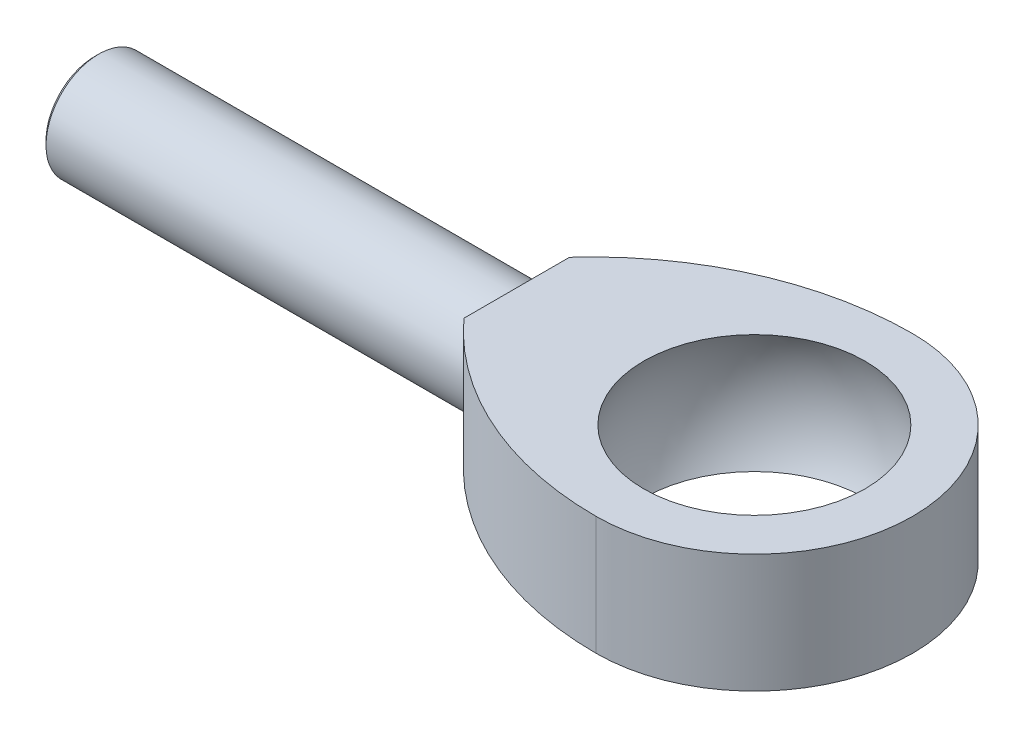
ISO-10303-21;
HEADER;
FILE_DESCRIPTION(('STEP AP214'),'2;1');
FILE_NAME('part.step','',(''),(''),'','','');
FILE_SCHEMA(('AUTOMOTIVE_DESIGN { 1 0 10303 214 1 1 1 1 }'));
ENDSEC;
DATA;
#1=APPLICATION_CONTEXT('core data for automotive mechanical design processes');
#2=APPLICATION_PROTOCOL_DEFINITION('international standard','automotive_design',2000,#1);
#3=PRODUCT_CONTEXT('',#1,'mechanical');
#4=PRODUCT('Part','Part','',(#3));
#5=PRODUCT_RELATED_PRODUCT_CATEGORY('part','',(#4));
#6=PRODUCT_DEFINITION_FORMATION('','',#4);
#7=PRODUCT_DEFINITION_CONTEXT('part definition',#1,'design');
#8=PRODUCT_DEFINITION('design','',#6,#7);
#9=PRODUCT_DEFINITION_SHAPE('','',#8);
#10=(LENGTH_UNIT() NAMED_UNIT(*) SI_UNIT(.MILLI.,.METRE.));
#11=(NAMED_UNIT(*) PLANE_ANGLE_UNIT() SI_UNIT($,.RADIAN.));
#12=(NAMED_UNIT(*) SI_UNIT($,.STERADIAN.) SOLID_ANGLE_UNIT());
#13=UNCERTAINTY_MEASURE_WITH_UNIT(LENGTH_MEASURE(1.E-05),#10,'distance_accuracy_value','');
#14=(GEOMETRIC_REPRESENTATION_CONTEXT(3) GLOBAL_UNCERTAINTY_ASSIGNED_CONTEXT((#13)) GLOBAL_UNIT_ASSIGNED_CONTEXT((#10,
#11,#12)) REPRESENTATION_CONTEXT('',''));
#15=CARTESIAN_POINT('',(0.,0.,0.));
#16=DIRECTION('',(0.,0.,1.));
#17=DIRECTION('',(1.,0.,0.));
#18=AXIS2_PLACEMENT_3D('',#15,#16,#17);
#19=CARTESIAN_POINT('',(-14.3002000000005,27.3888221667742,3.17500000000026));
#20=DIRECTION('',(-1.00000000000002,0.,0.));
#21=DIRECTION('',(0.,0.,1.00000000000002));
#22=AXIS2_PLACEMENT_3D('',#19,#20,#21);
#23=PLANE('',#22);
#24=CARTESIAN_POINT('',(-14.3002,1.45716771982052E-13,0.));
#25=DIRECTION('',(-1.00000000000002,0.,0.));
#26=DIRECTION('',(0.,0.,1.00000000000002));
#27=AXIS2_PLACEMENT_3D('',#24,#25,#26);
#28=CIRCLE('',#27,3.175);
#29=CARTESIAN_POINT('',(-14.3002,0.,3.17500000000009));
#30=VERTEX_POINT('',#29);
#31=CARTESIAN_POINT('',(-14.3002000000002,0.,-3.17499999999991));
#32=VERTEX_POINT('',#31);
#33=EDGE_CURVE('E105',#30,#32,#28,.T.);
#34=ORIENTED_EDGE('',*,*,#33,.F.);
#35=DIRECTION('',(0.,-1.00000000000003,0.));
#36=VECTOR('',#35,1.);
#37=CARTESIAN_POINT('',(-14.3002000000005,27.3888221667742,3.17500000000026));
#38=LINE('',#37,#36);
#39=CARTESIAN_POINT('',(-14.3002,3.56869999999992,3.17499999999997));
#40=VERTEX_POINT('',#39);
#41=EDGE_CURVE('E86',#40,#30,#38,.T.);
#42=ORIENTED_EDGE('',*,*,#41,.F.);
#43=DIRECTION('',(0.,0.,-1.00000000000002));
#44=VECTOR('',#43,1.);
#45=CARTESIAN_POINT('',(-14.3002,3.56869999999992,3.17499999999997));
#46=LINE('',#45,#44);
#47=CARTESIAN_POINT('',(-14.3002000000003,3.56870000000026,-3.17499999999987));
#48=VERTEX_POINT('',#47);
#49=EDGE_CURVE('E97',#40,#48,#46,.T.);
#50=ORIENTED_EDGE('',*,*,#49,.T.);
#51=DIRECTION('',(0.,-1.00000000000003,0.));
#52=VECTOR('',#51,1.);
#53=CARTESIAN_POINT('',(-14.3002000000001,27.3888221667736,-3.17499999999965));
#54=LINE('',#53,#52);
#55=EDGE_CURVE('E107',#48,#32,#54,.T.);
#56=ORIENTED_EDGE('',*,*,#55,.T.);
#57=EDGE_LOOP('',(#34,#42,#50,#56));
#58=FACE_BOUND('',#57,.T.);
#59=ADVANCED_FACE('F38',(#58),#23,.T.);
#60=CARTESIAN_POINT('',(-8.88178419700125E-13,32.8905871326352,1.11022302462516E-13));
#61=DIRECTION('',(0.,1.00000000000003,0.));
#62=DIRECTION('',(0.,0.,1.00000000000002));
#63=AXIS2_PLACEMENT_3D('',#60,#61,#62);
#64=CYLINDRICAL_SURFACE('',#63,9.525);
#65=CARTESIAN_POINT('',(-2.22044604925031E-13,3.56870000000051,0.));
#66=DIRECTION('',(0.,1.00000000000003,0.));
#67=DIRECTION('',(0.,0.,1.00000000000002));
#68=AXIS2_PLACEMENT_3D('',#65,#66,#67);
#69=CIRCLE('',#68,9.525);
#70=CARTESIAN_POINT('',(0.,3.56869999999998,9.52499999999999));
#71=VERTEX_POINT('',#70);
#72=CARTESIAN_POINT('',(0.,3.56870000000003,-9.52500000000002));
#73=VERTEX_POINT('',#72);
#74=EDGE_CURVE('E135',#71,#73,#69,.T.);
#75=ORIENTED_EDGE('',*,*,#74,.F.);
#76=DIRECTION('',(0.,-1.00000000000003,0.));
#77=VECTOR('',#76,1.);
#78=CARTESIAN_POINT('',(-6.66133814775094E-13,27.3888221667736,9.52500000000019));
#79=LINE('',#78,#77);
#80=CARTESIAN_POINT('',(0.,-3.56869999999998,9.52499999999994));
#81=VERTEX_POINT('',#80);
#82=EDGE_CURVE('E130',#71,#81,#79,.T.);
#83=ORIENTED_EDGE('',*,*,#82,.T.);
#84=CARTESIAN_POINT('',(-9.99200722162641E-13,-3.56870000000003,0.));
#85=DIRECTION('',(0.,1.00000000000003,0.));
#86=DIRECTION('',(0.,0.,1.00000000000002));
#87=AXIS2_PLACEMENT_3D('',#84,#85,#86);
#88=CIRCLE('',#87,9.525);
#89=CARTESIAN_POINT('',(-2.77555756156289E-13,-3.56869999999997,-9.52500000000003));
#90=VERTEX_POINT('',#89);
#91=EDGE_CURVE('E133',#81,#90,#88,.T.);
#92=ORIENTED_EDGE('',*,*,#91,.T.);
#93=DIRECTION('',(0.,-1.00000000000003,0.));
#94=VECTOR('',#93,1.);
#95=CARTESIAN_POINT('',(-6.10622663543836E-13,27.3888221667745,-9.52499999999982));
#96=LINE('',#95,#94);
#97=EDGE_CURVE('E61',#73,#90,#96,.T.);
#98=ORIENTED_EDGE('',*,*,#97,.F.);
#99=EDGE_LOOP('',(#75,#83,#92,#98));
#100=FACE_BOUND('',#99,.T.);
#101=ADVANCED_FACE('F154',(#100),#64,.T.);
#102=CARTESIAN_POINT('',(-9.52500000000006,-3.56869999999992,0.));
#103=DIRECTION('',(0.,-1.00000000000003,0.));
#104=DIRECTION('',(0.,0.,-1.00000000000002));
#105=AXIS2_PLACEMENT_3D('',#102,#103,#104);
#106=PLANE('',#105);
#107=CARTESIAN_POINT('',(-9.99200722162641E-13,-3.56870000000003,0.));
#108=DIRECTION('',(0.,1.00000000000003,0.));
#109=DIRECTION('',(0.,0.,1.00000000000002));
#110=AXIS2_PLACEMENT_3D('',#107,#108,#109);
#111=CIRCLE('',#110,6.66071111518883);
#112=CARTESIAN_POINT('',(-6.66071111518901,-3.56870000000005,0.));
#113=VERTEX_POINT('',#112);
#114=EDGE_CURVE('E112',#113,#113,#111,.T.);
#115=ORIENTED_EDGE('',*,*,#114,.T.);
#116=EDGE_LOOP('',(#115));
#117=FACE_BOUND('',#116,.T.);
#118=ORIENTED_EDGE('',*,*,#91,.F.);
#119=CARTESIAN_POINT('',(0.,-3.56869999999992,-9.7520252));
#120=DIRECTION('',(0.,-1.00000000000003,0.));
#121=DIRECTION('',(0.,0.,-1.00000000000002));
#122=AXIS2_PLACEMENT_3D('',#119,#120,#121);
#123=CIRCLE('',#122,19.2770252);
#124=CARTESIAN_POINT('',(-14.3002,-3.56869999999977,3.17500000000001));
#125=VERTEX_POINT('',#124);
#126=EDGE_CURVE('E109',#81,#125,#123,.T.);
#127=ORIENTED_EDGE('',*,*,#126,.T.);
#128=DIRECTION('',(0.,0.,-1.00000000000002));
#129=VECTOR('',#128,1.);
#130=CARTESIAN_POINT('',(-14.3002,-3.56869999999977,3.17500000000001));
#131=LINE('',#130,#129);
#132=CARTESIAN_POINT('',(-14.3002000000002,-3.56870000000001,-3.17499999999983));
#133=VERTEX_POINT('',#132);
#134=EDGE_CURVE('E101',#125,#133,#131,.T.);
#135=ORIENTED_EDGE('',*,*,#134,.T.);
#136=CARTESIAN_POINT('',(0.,-3.56870000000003,9.75202520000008));
#137=DIRECTION('',(0.,-1.00000000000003,0.));
#138=DIRECTION('',(0.,0.,1.00000000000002));
#139=AXIS2_PLACEMENT_3D('',#136,#137,#138);
#140=CIRCLE('',#139,19.2770252);
#141=EDGE_CURVE('E118',#133,#90,#140,.T.);
#142=ORIENTED_EDGE('',*,*,#141,.T.);
#143=EDGE_LOOP('',(#118,#127,#135,#142));
#144=FACE_BOUND('',#143,.T.);
#145=ADVANCED_FACE('F40',(#117,#144),#106,.T.);
#146=CARTESIAN_POINT('',(0.,0.,0.));
#147=DIRECTION('',(0.,1.00000000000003,0.));
#148=DIRECTION('',(-1.00000000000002,0.,0.));
#149=AXIS2_PLACEMENT_3D('',#146,#147,#148);
#150=SPHERICAL_SURFACE('',#149,7.5565);
#151=CARTESIAN_POINT('',(-2.22044604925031E-13,3.56870000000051,0.));
#152=DIRECTION('',(0.,1.00000000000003,0.));
#153=DIRECTION('',(0.,0.,1.00000000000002));
#154=AXIS2_PLACEMENT_3D('',#151,#152,#153);
#155=CIRCLE('',#154,6.66071111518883);
#156=CARTESIAN_POINT('',(-6.66071111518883,3.56870000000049,0.));
#157=VERTEX_POINT('',#156);
#158=EDGE_CURVE('E115',#157,#157,#155,.T.);
#159=CARTESIAN_POINT('',(-6.66071111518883,3.56870000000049,0.));
#160=CARTESIAN_POINT('',(-6.69728047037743,3.5004468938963,0.));
#161=CARTESIAN_POINT('',(-6.73280001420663,3.43163134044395,0.));
#162=CARTESIAN_POINT('',(-6.80170750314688,3.29294115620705,0.));
#163=CARTESIAN_POINT('',(-6.83509544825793,3.22306652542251,0.));
#164=CARTESIAN_POINT('',(-6.89970776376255,3.08232400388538,0.));
#165=CARTESIAN_POINT('',(-6.93093213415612,3.01145611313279,0.));
#166=CARTESIAN_POINT('',(-6.99118790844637,2.86879409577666,0.));
#167=CARTESIAN_POINT('',(-7.02021931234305,2.79699996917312,0.));
#168=CARTESIAN_POINT('',(-7.07606168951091,2.65255330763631,0.));
#169=CARTESIAN_POINT('',(-7.10287266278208,2.57990077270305,0.));
#170=CARTESIAN_POINT('',(-7.15424885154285,2.43380595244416,0.));
#171=CARTESIAN_POINT('',(-7.17881406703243,2.36036366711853,0.));
#172=CARTESIAN_POINT('',(-7.22567552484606,2.21275874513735,0.));
#173=CARTESIAN_POINT('',(-7.24797176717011,2.13859610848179,0.));
#174=CARTESIAN_POINT('',(-7.29027421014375,1.98962056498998,0.));
#175=CARTESIAN_POINT('',(-7.31028041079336,1.91480765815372,0.));
#176=CARTESIAN_POINT('',(-7.34798386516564,1.76460226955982,0.));
#177=CARTESIAN_POINT('',(-7.36568111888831,1.68920978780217,0.));
#178=CARTESIAN_POINT('',(-7.39874995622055,1.53791649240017,0.));
#179=CARTESIAN_POINT('',(-7.41412153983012,1.46201567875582,0.));
#180=CARTESIAN_POINT('',(-7.44252451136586,1.30977744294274,0.));
#181=CARTESIAN_POINT('',(-7.45555589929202,1.23344002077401,0.));
#182=CARTESIAN_POINT('',(-7.47926616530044,1.08040070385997,0.));
#183=CARTESIAN_POINT('',(-7.4899450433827,1.00369880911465,0.));
#184=CARTESIAN_POINT('',(-7.50894019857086,0.850003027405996,0.));
#185=CARTESIAN_POINT('',(-7.51725647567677,0.773009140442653,0.));
#186=CARTESIAN_POINT('',(-7.53151857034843,0.618802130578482,0.));
#187=CARTESIAN_POINT('',(-7.53746438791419,0.541589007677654,0.));
#188=CARTESIAN_POINT('',(-7.54697994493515,0.387016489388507,0.));
#189=CARTESIAN_POINT('',(-7.55054968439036,0.309657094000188,0.));
#190=CARTESIAN_POINT('',(-7.55530971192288,0.154865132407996,0.));
#191=CARTESIAN_POINT('',(-7.55650000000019,0.077432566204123,0.));
#192=CARTESIAN_POINT('',(-7.5565000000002,-0.0774325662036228,0.));
#193=CARTESIAN_POINT('',(-7.55530971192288,-0.154865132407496,0.));
#194=CARTESIAN_POINT('',(-7.55054968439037,-0.309657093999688,0.));
#195=CARTESIAN_POINT('',(-7.54697994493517,-0.387016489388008,0.));
#196=CARTESIAN_POINT('',(-7.53746438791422,-0.541589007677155,0.));
#197=CARTESIAN_POINT('',(-7.53151857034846,-0.618802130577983,0.));
#198=CARTESIAN_POINT('',(-7.51725647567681,-0.773009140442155,0.));
#199=CARTESIAN_POINT('',(-7.5089401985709,-0.850003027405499,0.));
#200=CARTESIAN_POINT('',(-7.48994504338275,-1.00369880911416,0.));
#201=CARTESIAN_POINT('',(-7.4792661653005,-1.08040070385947,0.));
#202=CARTESIAN_POINT('',(-7.45555589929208,-1.23344002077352,0.));
#203=CARTESIAN_POINT('',(-7.44252451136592,-1.30977744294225,0.));
#204=CARTESIAN_POINT('',(-7.4141215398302,-1.46201567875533,0.));
#205=CARTESIAN_POINT('',(-7.39874995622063,-1.53791649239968,0.));
#206=CARTESIAN_POINT('',(-7.3656811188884,-1.68920978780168,0.));
#207=CARTESIAN_POINT('',(-7.34798386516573,-1.76460226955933,0.));
#208=CARTESIAN_POINT('',(-7.31028041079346,-1.91480765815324,0.));
#209=CARTESIAN_POINT('',(-7.29027421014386,-1.9896205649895,0.));
#210=CARTESIAN_POINT('',(-7.24797176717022,-2.13859610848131,0.));
#211=CARTESIAN_POINT('',(-7.22567552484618,-2.21275874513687,0.));
#212=CARTESIAN_POINT('',(-7.17881406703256,-2.36036366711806,0.));
#213=CARTESIAN_POINT('',(-7.15424885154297,-2.43380595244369,0.));
#214=CARTESIAN_POINT('',(-7.10287266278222,-2.57990077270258,0.));
#215=CARTESIAN_POINT('',(-7.07606168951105,-2.65255330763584,0.));
#216=CARTESIAN_POINT('',(-7.0202193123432,-2.79699996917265,0.));
#217=CARTESIAN_POINT('',(-6.99118790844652,-2.8687940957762,0.));
#218=CARTESIAN_POINT('',(-6.93093213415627,-3.01145611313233,0.));
#219=CARTESIAN_POINT('',(-6.89970776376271,-3.08232400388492,0.));
#220=CARTESIAN_POINT('',(-6.8350954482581,-3.22306652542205,0.));
#221=CARTESIAN_POINT('',(-6.80170750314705,-3.2929411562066,0.));
#222=CARTESIAN_POINT('',(-6.73280001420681,-3.4316313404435,0.));
#223=CARTESIAN_POINT('',(-6.69728047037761,-3.50044689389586,0.));
#224=CARTESIAN_POINT('',(-6.66071111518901,-3.56870000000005,0.));
#225=B_SPLINE_CURVE_WITH_KNOTS('',3,(#159,#160,#161,#162,#163,#164,#165,#166,#167,#168,#169,
#170,#171,#172,#173,#174,#175,#176,#177,#178,#179,#180,#181,#182,#183,#184,#185,#186,#187,#188,
#189,#190,#191,#192,#193,#194,#195,#196,#197,#198,#199,#200,#201,#202,#203,#204,#205,#206,#207,
#208,#209,#210,#211,#212,#213,#214,#215,#216,#217,#218,#219,#220,#221,#222,#223,#224),
.UNSPECIFIED.,.F.,.F.,(4,2,2,2,2,2,2,2,2,2,2,2,2,2,2,2,2,2,2,2,2,2,2,2,2,2,2,2,2,2,2,2,4),(0.,
0.23228855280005,0.4645771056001,0.69686565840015,0.9291542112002,1.16144276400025,
1.3937313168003,1.62601986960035,1.8583084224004,2.09059697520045,2.3228855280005,
2.55517408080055,2.7874626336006,3.01975118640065,3.2520397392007,3.48432829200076,
3.71661684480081,3.94890539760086,4.18119395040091,4.41348250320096,4.64577105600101,
4.87805960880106,5.11034816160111,5.34263671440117,5.57492526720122,5.80721382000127,
6.03950237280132,6.27179092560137,6.50407947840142,6.73636803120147,6.96865658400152,
7.20094513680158,7.43323368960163),.UNSPECIFIED.);
#226=EDGE_CURVE('BSEAM140',#157,#113,#225,.T.);
#227=ORIENTED_EDGE('',*,*,#158,.T.);
#228=ORIENTED_EDGE('',*,*,#114,.F.);
#229=ORIENTED_EDGE('',*,*,#226,.T.);
#230=ORIENTED_EDGE('',*,*,#226,.F.);
#231=EDGE_LOOP('',(#227,#229,#228,#230));
#232=FACE_BOUND('',#231,.T.);
#233=ADVANCED_FACE('F140',(#232),#150,.F.);
#234=CARTESIAN_POINT('',(-9.52500000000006,3.56870000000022,0.));
#235=DIRECTION('',(0.,1.00000000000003,0.));
#236=DIRECTION('',(0.,0.,1.00000000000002));
#237=AXIS2_PLACEMENT_3D('',#234,#235,#236);
#238=PLANE('',#237);
#239=ORIENTED_EDGE('',*,*,#74,.T.);
#240=CARTESIAN_POINT('',(0.,3.56870000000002,9.75202520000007));
#241=DIRECTION('',(0.,1.00000000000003,0.));
#242=DIRECTION('',(0.,0.,1.00000000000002));
#243=AXIS2_PLACEMENT_3D('',#240,#241,#242);
#244=CIRCLE('',#243,19.2770252);
#245=EDGE_CURVE('E124',#48,#73,#244,.F.);
#246=ORIENTED_EDGE('',*,*,#245,.F.);
#247=ORIENTED_EDGE('',*,*,#49,.F.);
#248=CARTESIAN_POINT('',(0.,3.5687000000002,-9.75202519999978));
#249=DIRECTION('',(0.,1.00000000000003,0.));
#250=DIRECTION('',(0.,0.,1.00000000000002));
#251=AXIS2_PLACEMENT_3D('',#248,#249,#250);
#252=CIRCLE('',#251,19.2770252);
#253=EDGE_CURVE('E93',#71,#40,#252,.F.);
#254=ORIENTED_EDGE('',*,*,#253,.F.);
#255=EDGE_LOOP('',(#239,#246,#247,#254));
#256=FACE_BOUND('',#255,.T.);
#257=ORIENTED_EDGE('',*,*,#158,.F.);
#258=EDGE_LOOP('',(#257));
#259=FACE_BOUND('',#258,.T.);
#260=ADVANCED_FACE('F143',(#256,#259),#238,.T.);
#261=CARTESIAN_POINT('',(0.,27.3888221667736,-9.75202519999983));
#262=DIRECTION('',(0.,-1.00000000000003,0.));
#263=DIRECTION('',(0.,0.,-1.00000000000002));
#264=AXIS2_PLACEMENT_3D('',#261,#262,#263);
#265=CYLINDRICAL_SURFACE('',#264,19.2770252);
#266=ORIENTED_EDGE('',*,*,#82,.F.);
#267=ORIENTED_EDGE('',*,*,#253,.T.);
#268=ORIENTED_EDGE('',*,*,#41,.T.);
#269=EDGE_CURVE('E90',#30,#125,#38,.T.);
#270=ORIENTED_EDGE('',*,*,#269,.T.);
#271=ORIENTED_EDGE('',*,*,#126,.F.);
#272=EDGE_LOOP('',(#266,#267,#268,#270,#271));
#273=FACE_BOUND('',#272,.T.);
#274=ADVANCED_FACE('F88',(#273),#265,.T.);
#275=EDGE_CURVE('E53',#32,#30,#28,.T.);
#276=ORIENTED_EDGE('',*,*,#275,.F.);
#277=EDGE_CURVE('E128',#32,#133,#54,.T.);
#278=ORIENTED_EDGE('',*,*,#277,.T.);
#279=ORIENTED_EDGE('',*,*,#134,.F.);
#280=ORIENTED_EDGE('',*,*,#269,.F.);
#281=EDGE_LOOP('',(#276,#278,#279,#280));
#282=FACE_BOUND('',#281,.T.);
#283=ADVANCED_FACE('F99',(#282),#23,.T.);
#284=CARTESIAN_POINT('',(0.,27.3888221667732,9.75202519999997));
#285=DIRECTION('',(0.,-1.00000000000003,0.));
#286=DIRECTION('',(0.,0.,-1.00000000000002));
#287=AXIS2_PLACEMENT_3D('',#284,#285,#286);
#288=CYLINDRICAL_SURFACE('',#287,19.2770252);
#289=ORIENTED_EDGE('',*,*,#55,.F.);
#290=ORIENTED_EDGE('',*,*,#245,.T.);
#291=ORIENTED_EDGE('',*,*,#97,.T.);
#292=ORIENTED_EDGE('',*,*,#141,.F.);
#293=ORIENTED_EDGE('',*,*,#277,.F.);
#294=EDGE_LOOP('',(#289,#290,#291,#292,#293));
#295=FACE_BOUND('',#294,.T.);
#296=ADVANCED_FACE('F161',(#295),#288,.T.);
#297=CARTESIAN_POINT('',(-39.7002000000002,0.,0.));
#298=DIRECTION('',(1.00000000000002,0.,0.));
#299=DIRECTION('',(0.,0.,-1.00000000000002));
#300=AXIS2_PLACEMENT_3D('',#297,#298,#299);
#301=CYLINDRICAL_SURFACE('',#300,3.175);
#302=CARTESIAN_POINT('',(-39.446200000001,4.71844785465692E-13,2.63677968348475E-13));
#303=DIRECTION('',(-1.00000000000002,0.,0.));
#304=DIRECTION('',(0.,0.,1.00000000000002));
#305=AXIS2_PLACEMENT_3D('',#302,#303,#304);
#306=CIRCLE('',#305,3.175);
#307=CARTESIAN_POINT('',(-39.446200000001,4.78057524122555E-13,3.17500000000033));
#308=VERTEX_POINT('',#307);
#309=EDGE_CURVE('E11',#308,#308,#306,.F.);
#310=ORIENTED_EDGE('',*,*,#309,.T.);
#311=EDGE_LOOP('',(#310));
#312=FACE_BOUND('',#311,.T.);
#313=ORIENTED_EDGE('',*,*,#33,.T.);
#314=ORIENTED_EDGE('',*,*,#275,.T.);
#315=EDGE_LOOP('',(#313,#314));
#316=FACE_BOUND('',#315,.T.);
#317=ADVANCED_FACE('F111',(#312,#316),#301,.T.);
#318=CARTESIAN_POINT('',(-39.7002000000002,0.,0.));
#319=DIRECTION('',(-1.00000000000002,0.,0.));
#320=DIRECTION('',(0.,0.,1.00000000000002));
#321=AXIS2_PLACEMENT_3D('',#318,#319,#320);
#322=PLANE('',#321);
#323=CARTESIAN_POINT('',(-39.7002000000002,0.,0.));
#324=DIRECTION('',(-1.00000000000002,0.,0.));
#325=DIRECTION('',(0.,0.,1.00000000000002));
#326=AXIS2_PLACEMENT_3D('',#323,#324,#325);
#327=CIRCLE('',#326,2.921);
#328=CARTESIAN_POINT('',(-39.7002000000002,0.,2.92100000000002));
#329=VERTEX_POINT('',#328);
#330=EDGE_CURVE('E46',#329,#329,#327,.T.);
#331=ORIENTED_EDGE('',*,*,#330,.T.);
#332=EDGE_LOOP('',(#331));
#333=FACE_BOUND('',#332,.T.);
#334=ADVANCED_FACE('F169',(#333),#322,.T.);
#335=CARTESIAN_POINT('',(-39.7002000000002,0.,0.));
#336=DIRECTION('',(1.00000000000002,0.,0.));
#337=DIRECTION('',(0.,0.,-1.00000000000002));
#338=AXIS2_PLACEMENT_3D('',#335,#336,#337);
#339=CONICAL_SURFACE('',#338,2.921,0.785398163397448);
#340=ORIENTED_EDGE('',*,*,#309,.F.);
#341=EDGE_LOOP('',(#340));
#342=FACE_BOUND('',#341,.T.);
#343=ORIENTED_EDGE('',*,*,#330,.F.);
#344=EDGE_LOOP('',(#343));
#345=FACE_BOUND('',#344,.T.);
#346=ADVANCED_FACE('F175',(#342,#345),#339,.T.);
#347=CLOSED_SHELL('',(#59,#101,#145,#233,#260,#274,#283,#296,#317,#334,#346));
#348=MANIFOLD_SOLID_BREP('B2',#347);
#349=ADVANCED_BREP_SHAPE_REPRESENTATION('',(#18,#348),#14);
#350=SHAPE_DEFINITION_REPRESENTATION(#9,#349);
ENDSEC;
END-ISO-10303-21;
